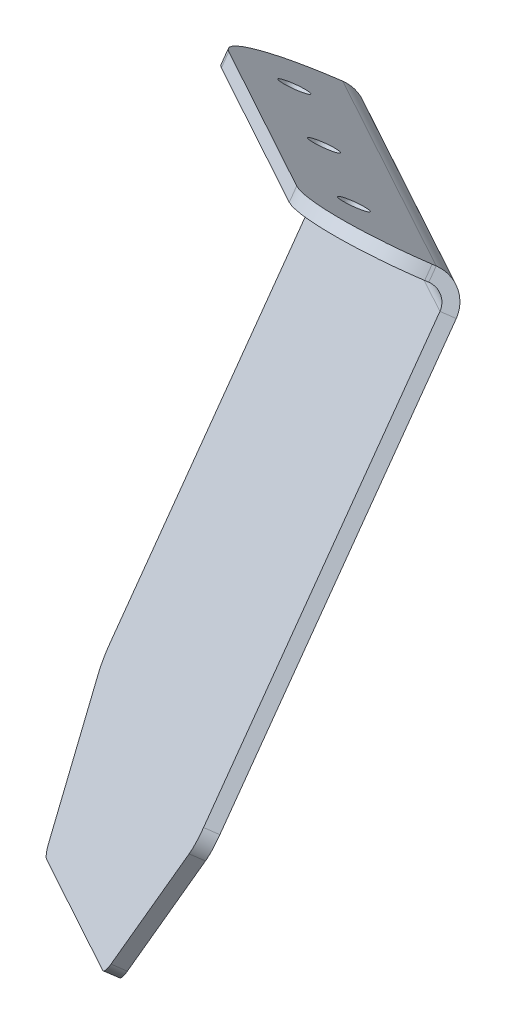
ISO-10303-21;
HEADER;
FILE_DESCRIPTION(('STEP AP214'),'2;1');
FILE_NAME('part.step','',(''),(''),'','','');
FILE_SCHEMA(('AUTOMOTIVE_DESIGN { 1 0 10303 214 1 1 1 1 }'));
ENDSEC;
DATA;
#1=APPLICATION_CONTEXT('core data for automotive mechanical design processes');
#2=APPLICATION_PROTOCOL_DEFINITION('international standard','automotive_design',2000,#1);
#3=PRODUCT_CONTEXT('',#1,'mechanical');
#4=PRODUCT('Part','Part','',(#3));
#5=PRODUCT_RELATED_PRODUCT_CATEGORY('part','',(#4));
#6=PRODUCT_DEFINITION_FORMATION('','',#4);
#7=PRODUCT_DEFINITION_CONTEXT('part definition',#1,'design');
#8=PRODUCT_DEFINITION('design','',#6,#7);
#9=PRODUCT_DEFINITION_SHAPE('','',#8);
#10=(LENGTH_UNIT() NAMED_UNIT(*) SI_UNIT(.MILLI.,.METRE.));
#11=(NAMED_UNIT(*) PLANE_ANGLE_UNIT() SI_UNIT($,.RADIAN.));
#12=(NAMED_UNIT(*) SI_UNIT($,.STERADIAN.) SOLID_ANGLE_UNIT());
#13=UNCERTAINTY_MEASURE_WITH_UNIT(LENGTH_MEASURE(1.E-05),#10,'distance_accuracy_value','');
#14=(GEOMETRIC_REPRESENTATION_CONTEXT(3) GLOBAL_UNCERTAINTY_ASSIGNED_CONTEXT((#13)) GLOBAL_UNIT_ASSIGNED_CONTEXT((#10,
#11,#12)) REPRESENTATION_CONTEXT('',''));
#15=CARTESIAN_POINT('',(0.,0.,0.));
#16=DIRECTION('',(0.,0.,1.));
#17=DIRECTION('',(1.,0.,0.));
#18=AXIS2_PLACEMENT_3D('',#15,#16,#17);
#19=CARTESIAN_POINT('',(-135.371691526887,-169.501902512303,88.8265453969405));
#20=DIRECTION('',(0.707106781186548,0.412762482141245,0.574131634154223));
#21=DIRECTION('',(0.5,0.282264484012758,-0.81873485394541));
#22=AXIS2_PLACEMENT_3D('',#19,#20,#21);
#23=CYLINDRICAL_SURFACE('',#22,3.175);
#24=CARTESIAN_POINT('',(-184.763100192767,-198.333361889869,48.7234507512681));
#25=DIRECTION('',(0.707106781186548,0.412762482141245,0.574131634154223));
#26=DIRECTION('',(0.630332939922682,0.,-0.776324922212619));
#27=AXIS2_PLACEMENT_3D('',#24,#25,#26);
#28=CIRCLE('',#27,3.175);
#29=CARTESIAN_POINT('',(-182.5180361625,-199.643882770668,46.9005828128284));
#30=VERTEX_POINT('',#29);
#31=CARTESIAN_POINT('',(-184.763100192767,-195.755437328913,46.8700943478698));
#32=VERTEX_POINT('',#31);
#33=EDGE_CURVE('E27',#30,#32,#28,.T.);
#34=ORIENTED_EDGE('',*,*,#33,.F.);
#35=DIRECTION('',(0.707106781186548,0.412762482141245,0.574131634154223));
#36=VECTOR('',#35,1.);
#37=CARTESIAN_POINT('',(-133.12662749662,-170.812423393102,87.0036774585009));
#38=LINE('',#37,#36);
#39=CARTESIAN_POINT('',(-83.7352188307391,-141.980964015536,127.106772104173));
#40=VERTEX_POINT('',#39);
#41=EDGE_CURVE('E467',#30,#40,#38,.T.);
#42=ORIENTED_EDGE('',*,*,#41,.T.);
#43=CARTESIAN_POINT('',(-85.9802828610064,-140.670443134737,128.929640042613));
#44=DIRECTION('',(0.707106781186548,0.412762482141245,0.574131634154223));
#45=DIRECTION('',(0.630332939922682,0.,-0.776324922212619));
#46=AXIS2_PLACEMENT_3D('',#43,#44,#45);
#47=CIRCLE('',#46,3.175);
#48=CARTESIAN_POINT('',(-85.9802828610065,-138.092518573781,127.076283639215));
#49=VERTEX_POINT('',#48);
#50=EDGE_CURVE('E228',#40,#49,#47,.T.);
#51=ORIENTED_EDGE('',*,*,#50,.T.);
#52=DIRECTION('',(0.707106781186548,0.412762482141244,0.574131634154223));
#53=VECTOR('',#52,1.);
#54=CARTESIAN_POINT('',(-66.2737357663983,-126.589131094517,143.076910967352));
#55=LINE('',#54,#53);
#56=EDGE_CURVE('E446',#32,#49,#55,.T.);
#57=ORIENTED_EDGE('',*,*,#56,.F.);
#58=EDGE_LOOP('',(#34,#42,#51,#57));
#59=FACE_BOUND('',#58,.T.);
#60=ADVANCED_FACE('F17',(#59),#23,.F.);
#61=CARTESIAN_POINT('',(-135.371691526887,-169.501902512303,88.8265453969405));
#62=DIRECTION('',(0.707106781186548,0.412762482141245,0.574131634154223));
#63=DIRECTION('',(0.5,0.282264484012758,-0.81873485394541));
#64=AXIS2_PLACEMENT_3D('',#61,#62,#63);
#65=CYLINDRICAL_SURFACE('',#64,5.715);
#66=CARTESIAN_POINT('',(-184.763100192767,-198.333361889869,48.7234507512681));
#67=DIRECTION('',(0.707106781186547,0.412762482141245,0.574131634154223));
#68=DIRECTION('',(0.630332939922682,0.,-0.776324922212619));
#69=AXIS2_PLACEMENT_3D('',#66,#67,#68);
#70=CIRCLE('',#69,5.715);
#71=CARTESIAN_POINT('',(-180.721984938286,-200.692299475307,45.4422884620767));
#72=VERTEX_POINT('',#71);
#73=CARTESIAN_POINT('',(-184.763100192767,-193.693097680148,45.3874092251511));
#74=VERTEX_POINT('',#73);
#75=EDGE_CURVE('E11',#72,#74,#70,.T.);
#76=ORIENTED_EDGE('',*,*,#75,.T.);
#77=DIRECTION('',(0.707106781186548,0.412762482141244,0.574131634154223));
#78=VECTOR('',#77,1.);
#79=CARTESIAN_POINT('',(-66.2737357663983,-124.526791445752,141.594225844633));
#80=LINE('',#79,#78);
#81=CARTESIAN_POINT('',(-85.9802828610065,-136.030178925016,125.593598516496));
#82=VERTEX_POINT('',#81);
#83=EDGE_CURVE('E556',#74,#82,#80,.T.);
#84=ORIENTED_EDGE('',*,*,#83,.T.);
#85=CARTESIAN_POINT('',(-85.9802828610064,-140.670443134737,128.929640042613));
#86=DIRECTION('',(0.707106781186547,0.412762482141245,0.574131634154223));
#87=DIRECTION('',(0.630332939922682,0.,-0.776324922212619));
#88=AXIS2_PLACEMENT_3D('',#85,#86,#87);
#89=CIRCLE('',#88,5.715);
#90=CARTESIAN_POINT('',(-81.9391676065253,-143.029380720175,125.648477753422));
#91=VERTEX_POINT('',#90);
#92=EDGE_CURVE('E20',#91,#82,#89,.T.);
#93=ORIENTED_EDGE('',*,*,#92,.F.);
#94=DIRECTION('',(0.707106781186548,0.412762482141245,0.574131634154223));
#95=VECTOR('',#94,1.);
#96=CARTESIAN_POINT('',(-131.330576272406,-171.86084009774,85.5453831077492));
#97=LINE('',#96,#95);
#98=EDGE_CURVE('E461',#72,#91,#97,.T.);
#99=ORIENTED_EDGE('',*,*,#98,.F.);
#100=EDGE_LOOP('',(#76,#84,#93,#99));
#101=FACE_BOUND('',#100,.T.);
#102=ADVANCED_FACE('F403',(#101),#65,.T.);
#103=CARTESIAN_POINT('',(-184.763100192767,-198.333361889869,48.7234507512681));
#104=DIRECTION('',(-0.707106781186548,-0.412762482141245,-0.574131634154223));
#105=DIRECTION('',(-0.630332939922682,0.,0.776324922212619));
#106=AXIS2_PLACEMENT_3D('',#103,#104,#105);
#107=PLANE('',#106);
#108=DIRECTION('',(0.707106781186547,-0.412762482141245,-0.574131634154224));
#109=VECTOR('',#108,1.);
#110=CARTESIAN_POINT('',(-182.5180361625,-199.643882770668,46.9005828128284));
#111=LINE('',#110,#109);
#112=EDGE_CURVE('E548',#30,#72,#111,.T.);
#113=ORIENTED_EDGE('',*,*,#112,.F.);
#114=ORIENTED_EDGE('',*,*,#33,.T.);
#115=DIRECTION('',(0.,0.811944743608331,-0.58373430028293));
#116=VECTOR('',#115,1.);
#117=CARTESIAN_POINT('',(-184.763100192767,-195.755437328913,46.8700943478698));
#118=LINE('',#117,#116);
#119=EDGE_CURVE('E484',#32,#74,#118,.T.);
#120=ORIENTED_EDGE('',*,*,#119,.T.);
#121=ORIENTED_EDGE('',*,*,#75,.F.);
#122=EDGE_LOOP('',(#113,#114,#120,#121));
#123=FACE_BOUND('',#122,.T.);
#124=ADVANCED_FACE('F395',(#123),#107,.T.);
#125=CARTESIAN_POINT('',(-85.9802828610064,-140.670443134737,128.929640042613));
#126=DIRECTION('',(-0.707106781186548,-0.412762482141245,-0.574131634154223));
#127=DIRECTION('',(-0.630332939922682,0.,0.776324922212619));
#128=AXIS2_PLACEMENT_3D('',#125,#126,#127);
#129=PLANE('',#128);
#130=DIRECTION('',(0.,0.811944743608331,-0.58373430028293));
#131=VECTOR('',#130,1.);
#132=CARTESIAN_POINT('',(-85.9802828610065,-138.092518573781,127.076283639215));
#133=LINE('',#132,#131);
#134=EDGE_CURVE('E450',#49,#82,#133,.T.);
#135=ORIENTED_EDGE('',*,*,#134,.F.);
#136=ORIENTED_EDGE('',*,*,#50,.F.);
#137=DIRECTION('',(0.707106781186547,-0.412762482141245,-0.574131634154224));
#138=VECTOR('',#137,1.);
#139=CARTESIAN_POINT('',(-83.7352188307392,-141.980964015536,127.106772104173));
#140=LINE('',#139,#138);
#141=EDGE_CURVE('E504',#40,#91,#140,.T.);
#142=ORIENTED_EDGE('',*,*,#141,.T.);
#143=ORIENTED_EDGE('',*,*,#92,.T.);
#144=EDGE_LOOP('',(#135,#136,#142,#143));
#145=FACE_BOUND('',#144,.T.);
#146=ADVANCED_FACE('F262',(#145),#129,.F.);
#147=CARTESIAN_POINT('',(-133.12662749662,-213.605971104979,117.769393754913));
#148=DIRECTION('',(0.707106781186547,-0.412762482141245,-0.574131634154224));
#149=DIRECTION('',(0.,-0.811944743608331,0.58373430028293));
#150=AXIS2_PLACEMENT_3D('',#147,#148,#149);
#151=PLANE('',#150);
#152=DIRECTION('',(0.5,0.865998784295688,-0.00679011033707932));
#153=VECTOR('',#152,1.);
#154=CARTESIAN_POINT('',(-83.7352188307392,-209.522587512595,175.664709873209));
#155=LINE('',#154,#153);
#156=CARTESIAN_POINT('',(-100.380603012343,-238.352352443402,175.890757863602));
#157=VERTEX_POINT('',#156);
#158=CARTESIAN_POINT('',(-85.0503468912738,-211.800386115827,175.682569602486));
#159=VERTEX_POINT('',#158);
#160=EDGE_CURVE('E179',#157,#159,#155,.T.);
#161=ORIENTED_EDGE('',*,*,#160,.T.);
#162=CARTESIAN_POINT('',(-88.2253468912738,-210.008006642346,170.483603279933));
#163=DIRECTION('',(-0.707106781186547,0.412762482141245,0.574131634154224));
#164=DIRECTION('',(-0.5,-0.865998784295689,0.0067901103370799));
#165=AXIS2_PLACEMENT_3D('',#162,#163,#164);
#166=CIRCLE('',#165,6.35);
#167=CARTESIAN_POINT('',(-83.7352188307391,-207.386964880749,174.129339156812));
#168=VERTEX_POINT('',#167);
#169=EDGE_CURVE('E209',#159,#168,#166,.T.);
#170=ORIENTED_EDGE('',*,*,#169,.T.);
#171=DIRECTION('',(0.,0.811944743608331,-0.58373430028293));
#172=VECTOR('',#171,1.);
#173=CARTESIAN_POINT('',(-83.7352188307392,-184.774511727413,157.872488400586));
#174=LINE('',#173,#172);
#175=EDGE_CURVE('E508',#168,#40,#174,.T.);
#176=ORIENTED_EDGE('',*,*,#175,.T.);
#177=ORIENTED_EDGE('',*,*,#41,.F.);
#178=DIRECTION('',(0.,-0.811944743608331,0.58373430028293));
#179=VECTOR('',#178,1.);
#180=CARTESIAN_POINT('',(-182.5180361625,-242.437430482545,77.6662991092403));
#181=LINE('',#180,#179);
#182=CARTESIAN_POINT('',(-182.5180361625,-265.049883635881,93.9231498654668));
#183=VERTEX_POINT('',#182);
#184=EDGE_CURVE('E551',#30,#183,#181,.T.);
#185=ORIENTED_EDGE('',*,*,#184,.T.);
#186=CARTESIAN_POINT('',(-178.027908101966,-262.428841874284,97.5688857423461));
#187=DIRECTION('',(-0.707106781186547,0.412762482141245,0.574131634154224));
#188=DIRECTION('',(-0.5,-0.865998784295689,0.0067901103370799));
#189=AXIS2_PLACEMENT_3D('',#186,#187,#188);
#190=CIRCLE('',#189,6.35);
#191=CARTESIAN_POINT('',(-181.202908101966,-267.927934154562,97.6120029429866));
#192=VERTEX_POINT('',#191);
#193=EDGE_CURVE('E578',#183,#192,#190,.T.);
#194=ORIENTED_EDGE('',*,*,#193,.T.);
#195=DIRECTION('',(0.5,-0.282264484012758,0.81873485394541));
#196=VECTOR('',#195,1.);
#197=CARTESIAN_POINT('',(-164.557523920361,-277.324735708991,124.868315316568));
#198=LINE('',#197,#196);
#199=CARTESIAN_POINT('',(-165.872651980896,-276.582307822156,122.714832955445));
#200=VERTEX_POINT('',#199);
#201=EDGE_CURVE('E531',#192,#200,#198,.T.);
#202=ORIENTED_EDGE('',*,*,#201,.T.);
#203=CARTESIAN_POINT('',(-162.697651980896,-271.083215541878,122.671715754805));
#204=DIRECTION('',(-0.707106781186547,0.412762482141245,0.574131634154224));
#205=DIRECTION('',(-0.5,-0.865998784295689,0.0067901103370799));
#206=AXIS2_PLACEMENT_3D('',#203,#204,#205);
#207=CIRCLE('',#206,6.35);
#208=CARTESIAN_POINT('',(-162.697651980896,-276.239064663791,126.378428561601));
#209=VERTEX_POINT('',#208);
#210=EDGE_CURVE('E479',#200,#209,#207,.T.);
#211=ORIENTED_EDGE('',*,*,#210,.T.);
#212=DIRECTION('',(0.707106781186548,0.412762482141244,0.574131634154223));
#213=VECTOR('',#212,1.);
#214=CARTESIAN_POINT('',(-133.12662749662,-258.977443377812,150.388466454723));
#215=LINE('',#214,#213);
#216=CARTESIAN_POINT('',(-103.555603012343,-241.715822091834,174.398504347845));
#217=VERTEX_POINT('',#216);
#218=EDGE_CURVE('E497',#209,#217,#215,.T.);
#219=ORIENTED_EDGE('',*,*,#218,.T.);
#220=CARTESIAN_POINT('',(-103.555603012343,-236.559972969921,170.691791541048));
#221=DIRECTION('',(-0.707106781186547,0.412762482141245,0.574131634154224));
#222=DIRECTION('',(-0.5,-0.865998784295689,0.0067901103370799));
#223=AXIS2_PLACEMENT_3D('',#220,#221,#222);
#224=CIRCLE('',#223,6.35);
#225=EDGE_CURVE('E195',#217,#157,#224,.T.);
#226=ORIENTED_EDGE('',*,*,#225,.T.);
#227=EDGE_LOOP('',(#161,#170,#176,#177,#185,#194,#202,#211,#219,#226));
#228=FACE_BOUND('',#227,.T.);
#229=ADVANCED_FACE('F258',(#228),#151,.F.);
#230=CARTESIAN_POINT('',(-131.330576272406,-214.654387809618,116.311099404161));
#231=DIRECTION('',(0.707106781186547,-0.412762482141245,-0.574131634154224));
#232=DIRECTION('',(0.,-0.811944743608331,0.58373430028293));
#233=AXIS2_PLACEMENT_3D('',#230,#231,#232);
#234=PLANE('',#233);
#235=DIRECTION('',(0.5,0.865998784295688,-0.00679011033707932));
#236=VECTOR('',#235,1.);
#237=CARTESIAN_POINT('',(-81.9391676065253,-210.571004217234,174.206415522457));
#238=LINE('',#237,#236);
#239=CARTESIAN_POINT('',(-98.584551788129,-239.400769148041,174.432463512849));
#240=VERTEX_POINT('',#239);
#241=CARTESIAN_POINT('',(-83.2542956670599,-212.848802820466,174.224275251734));
#242=VERTEX_POINT('',#241);
#243=EDGE_CURVE('E186',#240,#242,#238,.T.);
#244=ORIENTED_EDGE('',*,*,#243,.F.);
#245=CARTESIAN_POINT('',(-101.759551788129,-237.60838967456,169.233497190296));
#246=DIRECTION('',(-0.707106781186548,0.412762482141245,0.574131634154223));
#247=DIRECTION('',(-0.630332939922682,0.,-0.776324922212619));
#248=AXIS2_PLACEMENT_3D('',#245,#246,#247);
#249=CIRCLE('',#248,6.35);
#250=CARTESIAN_POINT('',(-101.759551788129,-242.764238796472,172.940209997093));
#251=VERTEX_POINT('',#250);
#252=EDGE_CURVE('E41',#251,#240,#249,.T.);
#253=ORIENTED_EDGE('',*,*,#252,.F.);
#254=DIRECTION('',(0.707106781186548,0.412762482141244,0.574131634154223));
#255=VECTOR('',#254,1.);
#256=CARTESIAN_POINT('',(-131.330576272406,-260.025860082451,148.930172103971));
#257=LINE('',#256,#255);
#258=CARTESIAN_POINT('',(-160.901600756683,-277.28748136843,124.920134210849));
#259=VERTEX_POINT('',#258);
#260=EDGE_CURVE('E496',#259,#251,#257,.T.);
#261=ORIENTED_EDGE('',*,*,#260,.F.);
#262=CARTESIAN_POINT('',(-160.901600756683,-272.131632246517,121.213421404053));
#263=DIRECTION('',(-0.707106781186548,0.412762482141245,0.574131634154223));
#264=DIRECTION('',(-0.630332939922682,0.,-0.776324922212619));
#265=AXIS2_PLACEMENT_3D('',#262,#263,#264);
#266=CIRCLE('',#265,6.35);
#267=CARTESIAN_POINT('',(-164.076600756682,-277.630724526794,121.256538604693));
#268=VERTEX_POINT('',#267);
#269=EDGE_CURVE('E478',#268,#259,#266,.T.);
#270=ORIENTED_EDGE('',*,*,#269,.F.);
#271=DIRECTION('',(0.5,-0.282264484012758,0.81873485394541));
#272=VECTOR('',#271,1.);
#273=CARTESIAN_POINT('',(-162.761472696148,-278.37315241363,123.410020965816));
#274=LINE('',#273,#272);
#275=CARTESIAN_POINT('',(-179.406856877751,-268.9763508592,96.1537085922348));
#276=VERTEX_POINT('',#275);
#277=EDGE_CURVE('E530',#276,#268,#274,.T.);
#278=ORIENTED_EDGE('',*,*,#277,.F.);
#279=CARTESIAN_POINT('',(-176.231856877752,-263.477258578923,96.1105913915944));
#280=DIRECTION('',(-0.707106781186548,0.412762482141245,0.574131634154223));
#281=DIRECTION('',(-0.630332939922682,0.,-0.776324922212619));
#282=AXIS2_PLACEMENT_3D('',#279,#280,#281);
#283=CIRCLE('',#282,6.35);
#284=CARTESIAN_POINT('',(-180.721984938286,-266.09830034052,92.4648555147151));
#285=VERTEX_POINT('',#284);
#286=EDGE_CURVE('E587',#285,#276,#283,.T.);
#287=ORIENTED_EDGE('',*,*,#286,.F.);
#288=DIRECTION('',(0.,-0.811944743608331,0.58373430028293));
#289=VECTOR('',#288,1.);
#290=CARTESIAN_POINT('',(-180.721984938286,-243.485847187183,76.2080047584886));
#291=LINE('',#290,#289);
#292=EDGE_CURVE('E509',#72,#285,#291,.T.);
#293=ORIENTED_EDGE('',*,*,#292,.F.);
#294=ORIENTED_EDGE('',*,*,#98,.T.);
#295=DIRECTION('',(0.,0.811944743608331,-0.58373430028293));
#296=VECTOR('',#295,1.);
#297=CARTESIAN_POINT('',(-81.9391676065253,-185.822928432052,156.414194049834));
#298=LINE('',#297,#296);
#299=CARTESIAN_POINT('',(-81.9391676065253,-208.435381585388,172.67104480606));
#300=VERTEX_POINT('',#299);
#301=EDGE_CURVE('E202',#300,#91,#298,.T.);
#302=ORIENTED_EDGE('',*,*,#301,.F.);
#303=CARTESIAN_POINT('',(-86.4292956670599,-211.056423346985,169.025308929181));
#304=DIRECTION('',(-0.707106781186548,0.412762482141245,0.574131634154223));
#305=DIRECTION('',(-0.630332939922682,0.,-0.776324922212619));
#306=AXIS2_PLACEMENT_3D('',#303,#304,#305);
#307=CIRCLE('',#306,6.35);
#308=EDGE_CURVE('E198',#242,#300,#307,.T.);
#309=ORIENTED_EDGE('',*,*,#308,.F.);
#310=EDGE_LOOP('',(#244,#253,#261,#270,#278,#287,#293,#294,#302,#309));
#311=FACE_BOUND('',#310,.T.);
#312=ADVANCED_FACE('F199',(#311),#234,.T.);
#313=CARTESIAN_POINT('',(-103.555603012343,-236.559972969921,170.691791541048));
#314=DIRECTION('',(0.707106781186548,-0.412762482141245,-0.574131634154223));
#315=DIRECTION('',(-0.630332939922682,0.,-0.776324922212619));
#316=AXIS2_PLACEMENT_3D('',#313,#314,#315);
#317=CYLINDRICAL_SURFACE('',#316,6.35);
#318=ORIENTED_EDGE('',*,*,#225,.F.);
#319=DIRECTION('',(0.707106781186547,-0.412762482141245,-0.574131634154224));
#320=VECTOR('',#319,1.);
#321=CARTESIAN_POINT('',(-103.555603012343,-241.715822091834,174.398504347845));
#322=LINE('',#321,#320);
#323=EDGE_CURVE('E563',#217,#251,#322,.T.);
#324=ORIENTED_EDGE('',*,*,#323,.T.);
#325=ORIENTED_EDGE('',*,*,#252,.T.);
#326=DIRECTION('',(0.707106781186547,-0.412762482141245,-0.574131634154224));
#327=VECTOR('',#326,1.);
#328=CARTESIAN_POINT('',(-100.380603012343,-238.352352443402,175.890757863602));
#329=LINE('',#328,#327);
#330=EDGE_CURVE('E192',#157,#240,#329,.T.);
#331=ORIENTED_EDGE('',*,*,#330,.F.);
#332=EDGE_LOOP('',(#318,#324,#325,#331));
#333=FACE_BOUND('',#332,.T.);
#334=ADVANCED_FACE('F376',(#333),#317,.T.);
#335=CARTESIAN_POINT('',(-83.7352188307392,-209.522587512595,175.664709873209));
#336=DIRECTION('',(0.5,-0.282264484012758,0.81873485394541));
#337=DIRECTION('',(-0.491602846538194,-0.870819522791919,0.));
#338=AXIS2_PLACEMENT_3D('',#335,#336,#337);
#339=PLANE('',#338);
#340=DIRECTION('',(0.707106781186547,-0.412762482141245,-0.574131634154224));
#341=VECTOR('',#340,1.);
#342=CARTESIAN_POINT('',(-85.0503468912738,-211.800386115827,175.682569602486));
#343=LINE('',#342,#341);
#344=EDGE_CURVE('E190',#159,#242,#343,.T.);
#345=ORIENTED_EDGE('',*,*,#344,.F.);
#346=ORIENTED_EDGE('',*,*,#160,.F.);
#347=ORIENTED_EDGE('',*,*,#330,.T.);
#348=ORIENTED_EDGE('',*,*,#243,.T.);
#349=EDGE_LOOP('',(#345,#346,#347,#348));
#350=FACE_BOUND('',#349,.T.);
#351=ADVANCED_FACE('F188',(#350),#339,.T.);
#352=CARTESIAN_POINT('',(-88.2253468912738,-210.008006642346,170.483603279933));
#353=DIRECTION('',(0.707106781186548,-0.412762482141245,-0.574131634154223));
#354=DIRECTION('',(-0.630332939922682,0.,-0.776324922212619));
#355=AXIS2_PLACEMENT_3D('',#352,#353,#354);
#356=CYLINDRICAL_SURFACE('',#355,6.35);
#357=DIRECTION('',(0.707106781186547,-0.412762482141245,-0.574131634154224));
#358=VECTOR('',#357,1.);
#359=CARTESIAN_POINT('',(-83.7352188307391,-207.386964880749,174.129339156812));
#360=LINE('',#359,#358);
#361=EDGE_CURVE('E597',#168,#300,#360,.T.);
#362=ORIENTED_EDGE('',*,*,#361,.F.);
#363=ORIENTED_EDGE('',*,*,#169,.F.);
#364=ORIENTED_EDGE('',*,*,#344,.T.);
#365=ORIENTED_EDGE('',*,*,#308,.T.);
#366=EDGE_LOOP('',(#362,#363,#364,#365));
#367=FACE_BOUND('',#366,.T.);
#368=ADVANCED_FACE('F208',(#367),#356,.T.);
#369=CARTESIAN_POINT('',(-83.7352188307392,-184.774511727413,157.872488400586));
#370=DIRECTION('',(-0.707106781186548,-0.412762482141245,-0.574131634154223));
#371=DIRECTION('',(-0.630332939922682,0.,0.776324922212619));
#372=AXIS2_PLACEMENT_3D('',#369,#370,#371);
#373=PLANE('',#372);
#374=ORIENTED_EDGE('',*,*,#141,.F.);
#375=ORIENTED_EDGE('',*,*,#175,.F.);
#376=ORIENTED_EDGE('',*,*,#361,.T.);
#377=ORIENTED_EDGE('',*,*,#301,.T.);
#378=EDGE_LOOP('',(#374,#375,#376,#377));
#379=FACE_BOUND('',#378,.T.);
#380=ADVANCED_FACE('F245',(#379),#373,.F.);
#381=CARTESIAN_POINT('',(-182.5180361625,-242.437430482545,77.6662991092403));
#382=DIRECTION('',(0.707106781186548,0.412762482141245,0.574131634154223));
#383=DIRECTION('',(0.,-0.81194474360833,0.583734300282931));
#384=AXIS2_PLACEMENT_3D('',#381,#382,#383);
#385=PLANE('',#384);
#386=DIRECTION('',(0.707106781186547,-0.412762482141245,-0.574131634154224));
#387=VECTOR('',#386,1.);
#388=CARTESIAN_POINT('',(-182.5180361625,-265.049883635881,93.9231498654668));
#389=LINE('',#388,#387);
#390=EDGE_CURVE('E582',#183,#285,#389,.T.);
#391=ORIENTED_EDGE('',*,*,#390,.F.);
#392=ORIENTED_EDGE('',*,*,#184,.F.);
#393=ORIENTED_EDGE('',*,*,#112,.T.);
#394=ORIENTED_EDGE('',*,*,#292,.T.);
#395=EDGE_LOOP('',(#391,#392,#393,#394));
#396=FACE_BOUND('',#395,.T.);
#397=ADVANCED_FACE('F240',(#396),#385,.F.);
#398=CARTESIAN_POINT('',(-178.027908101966,-262.428841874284,97.5688857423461));
#399=DIRECTION('',(0.707106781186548,-0.412762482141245,-0.574131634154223));
#400=DIRECTION('',(-0.630332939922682,0.,-0.776324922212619));
#401=AXIS2_PLACEMENT_3D('',#398,#399,#400);
#402=CYLINDRICAL_SURFACE('',#401,6.35);
#403=DIRECTION('',(0.707106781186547,-0.412762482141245,-0.574131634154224));
#404=VECTOR('',#403,1.);
#405=CARTESIAN_POINT('',(-181.202908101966,-267.927934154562,97.6120029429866));
#406=LINE('',#405,#404);
#407=EDGE_CURVE('E526',#192,#276,#406,.T.);
#408=ORIENTED_EDGE('',*,*,#407,.F.);
#409=ORIENTED_EDGE('',*,*,#193,.F.);
#410=ORIENTED_EDGE('',*,*,#390,.T.);
#411=ORIENTED_EDGE('',*,*,#286,.T.);
#412=EDGE_LOOP('',(#408,#409,#410,#411));
#413=FACE_BOUND('',#412,.T.);
#414=ADVANCED_FACE('F244',(#413),#402,.T.);
#415=CARTESIAN_POINT('',(-164.557523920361,-277.324735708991,124.868315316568));
#416=DIRECTION('',(-0.5,-0.865998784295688,0.0067901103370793));
#417=DIRECTION('',(-0.866018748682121,0.500011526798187,0.));
#418=AXIS2_PLACEMENT_3D('',#415,#416,#417);
#419=PLANE('',#418);
#420=DIRECTION('',(0.707106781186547,-0.412762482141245,-0.574131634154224));
#421=VECTOR('',#420,1.);
#422=CARTESIAN_POINT('',(-165.872651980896,-276.582307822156,122.714832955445));
#423=LINE('',#422,#421);
#424=EDGE_CURVE('E474',#200,#268,#423,.T.);
#425=ORIENTED_EDGE('',*,*,#424,.F.);
#426=ORIENTED_EDGE('',*,*,#201,.F.);
#427=ORIENTED_EDGE('',*,*,#407,.T.);
#428=ORIENTED_EDGE('',*,*,#277,.T.);
#429=EDGE_LOOP('',(#425,#426,#427,#428));
#430=FACE_BOUND('',#429,.T.);
#431=ADVANCED_FACE('F341',(#430),#419,.T.);
#432=CARTESIAN_POINT('',(-162.697651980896,-271.083215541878,122.671715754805));
#433=DIRECTION('',(0.707106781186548,-0.412762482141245,-0.574131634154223));
#434=DIRECTION('',(-0.630332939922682,0.,-0.776324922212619));
#435=AXIS2_PLACEMENT_3D('',#432,#433,#434);
#436=CYLINDRICAL_SURFACE('',#435,6.35);
#437=DIRECTION('',(0.707106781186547,-0.412762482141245,-0.574131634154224));
#438=VECTOR('',#437,1.);
#439=CARTESIAN_POINT('',(-162.697651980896,-276.239064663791,126.378428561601));
#440=LINE('',#439,#438);
#441=EDGE_CURVE('E492',#209,#259,#440,.T.);
#442=ORIENTED_EDGE('',*,*,#441,.F.);
#443=ORIENTED_EDGE('',*,*,#210,.F.);
#444=ORIENTED_EDGE('',*,*,#424,.T.);
#445=ORIENTED_EDGE('',*,*,#269,.T.);
#446=EDGE_LOOP('',(#442,#443,#444,#445));
#447=FACE_BOUND('',#446,.T.);
#448=ADVANCED_FACE('F337',(#447),#436,.T.);
#449=CARTESIAN_POINT('',(-133.12662749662,-258.977443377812,150.388466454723));
#450=DIRECTION('',(0.,0.811944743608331,-0.58373430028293));
#451=DIRECTION('',(-1.,0.,0.));
#452=AXIS2_PLACEMENT_3D('',#449,#450,#451);
#453=PLANE('',#452);
#454=ORIENTED_EDGE('',*,*,#323,.F.);
#455=ORIENTED_EDGE('',*,*,#218,.F.);
#456=ORIENTED_EDGE('',*,*,#441,.T.);
#457=ORIENTED_EDGE('',*,*,#260,.T.);
#458=EDGE_LOOP('',(#454,#455,#456,#457));
#459=FACE_BOUND('',#458,.T.);
#460=ADVANCED_FACE('F332',(#459),#453,.F.);
#461=CARTESIAN_POINT('',(0.,-165.275383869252,89.2662995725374));
#462=DIRECTION('',(0.,-0.811944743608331,0.58373430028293));
#463=DIRECTION('',(-1.,0.,0.));
#464=AXIS2_PLACEMENT_3D('',#461,#462,#463);
#465=PLANE('',#464);
#466=DIRECTION('',(-0.707106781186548,-0.412762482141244,-0.574131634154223));
#467=VECTOR('',#466,1.);
#468=CARTESIAN_POINT('',(-149.291088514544,-158.798748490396,98.2749702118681));
#469=LINE('',#468,#467);
#470=CARTESIAN_POINT('',(-113.370064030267,-137.830414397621,127.440857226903));
#471=VERTEX_POINT('',#470);
#472=CARTESIAN_POINT('',(-185.212112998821,-179.767082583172,69.1090831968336));
#473=VERTEX_POINT('',#472);
#474=EDGE_CURVE('E516',#471,#473,#469,.T.);
#475=ORIENTED_EDGE('',*,*,#474,.T.);
#476=CARTESIAN_POINT('',(-171.741728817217,-187.630207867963,58.1718755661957));
#477=DIRECTION('',(0.,-0.811944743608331,0.58373430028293));
#478=DIRECTION('',(0.,-0.58373430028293,-0.811944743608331));
#479=AXIS2_PLACEMENT_3D('',#476,#477,#478);
#480=CIRCLE('',#479,19.05);
#481=CARTESIAN_POINT('',(-185.212112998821,-195.493333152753,47.2346679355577));
#482=VERTEX_POINT('',#481);
#483=EDGE_CURVE('E503',#473,#482,#480,.T.);
#484=ORIENTED_EDGE('',*,*,#483,.T.);
#485=DIRECTION('',(0.707106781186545,-0.412762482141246,-0.574131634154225));
#486=VECTOR('',#485,1.);
#487=CARTESIAN_POINT('',(-182.967048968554,-196.803854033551,45.411799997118));
#488=LINE('',#487,#486);
#489=EDGE_CURVE('E488',#482,#32,#488,.T.);
#490=ORIENTED_EDGE('',*,*,#489,.T.);
#491=ORIENTED_EDGE('',*,*,#56,.T.);
#492=DIRECTION('',(-0.707106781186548,0.412762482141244,0.574131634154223));
#493=VECTOR('',#492,1.);
#494=CARTESIAN_POINT('',(-84.1842316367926,-139.14093527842,125.617989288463));
#495=LINE('',#494,#493);
#496=CARTESIAN_POINT('',(-86.4292956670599,-137.830414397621,127.440857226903));
#497=VERTEX_POINT('',#496);
#498=EDGE_CURVE('E442',#49,#497,#495,.T.);
#499=ORIENTED_EDGE('',*,*,#498,.T.);
#500=CARTESIAN_POINT('',(-99.8996798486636,-145.693539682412,116.503649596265));
#501=DIRECTION('',(0.,-0.811944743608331,0.58373430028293));
#502=DIRECTION('',(0.,-0.58373430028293,-0.811944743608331));
#503=AXIS2_PLACEMENT_3D('',#500,#501,#502);
#504=CIRCLE('',#503,19.05);
#505=EDGE_CURVE('E429',#497,#471,#504,.T.);
#506=ORIENTED_EDGE('',*,*,#505,.T.);
#507=EDGE_LOOP('',(#475,#484,#490,#491,#499,#506));
#508=FACE_BOUND('',#507,.T.);
#509=CARTESIAN_POINT('',(-173.986792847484,-181.077603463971,67.286215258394));
#510=DIRECTION('',(0.,0.811944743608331,-0.58373430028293));
#511=DIRECTION('',(0.,0.58373430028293,0.811944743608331));
#512=AXIS2_PLACEMENT_3D('',#509,#510,#511);
#513=CIRCLE('',#512,2.5527);
#514=CARTESIAN_POINT('',(-173.986792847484,-179.587504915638,69.358866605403));
#515=VERTEX_POINT('',#514);
#516=EDGE_CURVE('E438',#515,#515,#513,.T.);
#517=ORIENTED_EDGE('',*,*,#516,.T.);
#518=EDGE_LOOP('',(#517));
#519=FACE_BOUND('',#518,.T.);
#520=CARTESIAN_POINT('',(-111.125,-144.383018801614,118.326517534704));
#521=DIRECTION('',(0.,0.811944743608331,-0.58373430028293));
#522=DIRECTION('',(0.,0.58373430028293,0.811944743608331));
#523=AXIS2_PLACEMENT_3D('',#520,#521,#522);
#524=CIRCLE('',#523,2.5527);
#525=CARTESIAN_POINT('',(-111.125,-142.892920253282,120.399168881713));
#526=VERTEX_POINT('',#525);
#527=EDGE_CURVE('E538',#526,#526,#524,.T.);
#528=ORIENTED_EDGE('',*,*,#527,.T.);
#529=EDGE_LOOP('',(#528));
#530=FACE_BOUND('',#529,.T.);
#531=CARTESIAN_POINT('',(-142.555896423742,-162.730311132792,92.8063663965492));
#532=DIRECTION('',(0.,0.811944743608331,-0.58373430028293));
#533=DIRECTION('',(0.,0.58373430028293,0.811944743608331));
#534=AXIS2_PLACEMENT_3D('',#531,#532,#533);
#535=CIRCLE('',#534,2.5527);
#536=CARTESIAN_POINT('',(-142.555896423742,-161.24021258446,94.8790177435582));
#537=VERTEX_POINT('',#536);
#538=EDGE_CURVE('E462',#537,#537,#535,.T.);
#539=ORIENTED_EDGE('',*,*,#538,.T.);
#540=EDGE_LOOP('',(#539));
#541=FACE_BOUND('',#540,.T.);
#542=ADVANCED_FACE('F324',(#508,#519,#530,#541),#465,.T.);
#543=CARTESIAN_POINT('',(0.,-163.213044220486,87.7836144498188));
#544=DIRECTION('',(0.,-0.811944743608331,0.58373430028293));
#545=DIRECTION('',(-1.,0.,0.));
#546=AXIS2_PLACEMENT_3D('',#543,#544,#545);
#547=PLANE('',#546);
#548=DIRECTION('',(-0.707106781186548,-0.412762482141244,-0.574131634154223));
#549=VECTOR('',#548,1.);
#550=CARTESIAN_POINT('',(-149.291088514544,-156.736408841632,96.7922850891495));
#551=LINE('',#550,#549);
#552=CARTESIAN_POINT('',(-113.370064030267,-135.768074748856,125.958172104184));
#553=VERTEX_POINT('',#552);
#554=CARTESIAN_POINT('',(-185.212112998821,-177.704742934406,67.626398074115));
#555=VERTEX_POINT('',#554);
#556=EDGE_CURVE('E471',#553,#555,#551,.T.);
#557=ORIENTED_EDGE('',*,*,#556,.F.);
#558=CARTESIAN_POINT('',(-99.8996798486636,-143.631200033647,115.020964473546));
#559=DIRECTION('',(0.,-0.811944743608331,0.58373430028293));
#560=DIRECTION('',(0.,-0.58373430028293,-0.811944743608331));
#561=AXIS2_PLACEMENT_3D('',#558,#559,#560);
#562=CIRCLE('',#561,19.05);
#563=CARTESIAN_POINT('',(-86.4292956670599,-135.768074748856,125.958172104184));
#564=VERTEX_POINT('',#563);
#565=EDGE_CURVE('E437',#564,#553,#562,.T.);
#566=ORIENTED_EDGE('',*,*,#565,.F.);
#567=DIRECTION('',(-0.707106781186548,0.412762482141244,0.574131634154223));
#568=VECTOR('',#567,1.);
#569=CARTESIAN_POINT('',(-84.1842316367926,-137.078595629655,124.135304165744));
#570=LINE('',#569,#568);
#571=EDGE_CURVE('E454',#82,#564,#570,.T.);
#572=ORIENTED_EDGE('',*,*,#571,.F.);
#573=ORIENTED_EDGE('',*,*,#83,.F.);
#574=DIRECTION('',(0.707106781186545,-0.412762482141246,-0.574131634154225));
#575=VECTOR('',#574,1.);
#576=CARTESIAN_POINT('',(-182.967048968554,-194.741514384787,43.9291148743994));
#577=LINE('',#576,#575);
#578=CARTESIAN_POINT('',(-185.212112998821,-193.430993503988,45.7519828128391));
#579=VERTEX_POINT('',#578);
#580=EDGE_CURVE('E513',#579,#74,#577,.T.);
#581=ORIENTED_EDGE('',*,*,#580,.F.);
#582=CARTESIAN_POINT('',(-171.741728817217,-185.567868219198,56.689190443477));
#583=DIRECTION('',(0.,-0.811944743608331,0.58373430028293));
#584=DIRECTION('',(0.,-0.58373430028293,-0.811944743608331));
#585=AXIS2_PLACEMENT_3D('',#582,#583,#584);
#586=CIRCLE('',#585,19.05);
#587=EDGE_CURVE('E502',#555,#579,#586,.T.);
#588=ORIENTED_EDGE('',*,*,#587,.F.);
#589=EDGE_LOOP('',(#557,#566,#572,#573,#581,#588));
#590=FACE_BOUND('',#589,.T.);
#591=CARTESIAN_POINT('',(-173.986792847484,-179.015263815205,65.8035301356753));
#592=DIRECTION('',(0.,0.811944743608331,-0.58373430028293));
#593=DIRECTION('',(0.,0.58373430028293,0.811944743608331));
#594=AXIS2_PLACEMENT_3D('',#591,#592,#593);
#595=CIRCLE('',#594,2.5527);
#596=CARTESIAN_POINT('',(-173.986792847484,-177.525165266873,67.8761814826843));
#597=VERTEX_POINT('',#596);
#598=EDGE_CURVE('E543',#597,#597,#595,.T.);
#599=ORIENTED_EDGE('',*,*,#598,.F.);
#600=EDGE_LOOP('',(#599));
#601=FACE_BOUND('',#600,.T.);
#602=CARTESIAN_POINT('',(-111.125,-142.320679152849,116.843832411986));
#603=DIRECTION('',(0.,0.811944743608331,-0.58373430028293));
#604=DIRECTION('',(0.,0.58373430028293,0.811944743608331));
#605=AXIS2_PLACEMENT_3D('',#602,#603,#604);
#606=CIRCLE('',#605,2.5527);
#607=CARTESIAN_POINT('',(-111.125,-140.830580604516,118.916483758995));
#608=VERTEX_POINT('',#607);
#609=EDGE_CURVE('E465',#608,#608,#606,.T.);
#610=ORIENTED_EDGE('',*,*,#609,.F.);
#611=EDGE_LOOP('',(#610));
#612=FACE_BOUND('',#611,.T.);
#613=CARTESIAN_POINT('',(-142.555896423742,-160.667971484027,91.3236812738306));
#614=DIRECTION('',(0.,0.811944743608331,-0.58373430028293));
#615=DIRECTION('',(0.,0.58373430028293,0.811944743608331));
#616=AXIS2_PLACEMENT_3D('',#613,#614,#615);
#617=CIRCLE('',#616,2.5527);
#618=CARTESIAN_POINT('',(-142.555896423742,-159.177872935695,93.3963326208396));
#619=VERTEX_POINT('',#618);
#620=EDGE_CURVE('E466',#619,#619,#617,.T.);
#621=ORIENTED_EDGE('',*,*,#620,.F.);
#622=EDGE_LOOP('',(#621));
#623=FACE_BOUND('',#622,.T.);
#624=ADVANCED_FACE('F316',(#590,#601,#612,#623),#547,.F.);
#625=CARTESIAN_POINT('',(-99.8996798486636,-145.693539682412,116.503649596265));
#626=DIRECTION('',(0.,-0.811944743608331,0.58373430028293));
#627=DIRECTION('',(0.,-0.58373430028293,-0.811944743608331));
#628=AXIS2_PLACEMENT_3D('',#625,#626,#627);
#629=CYLINDRICAL_SURFACE('',#628,19.05);
#630=ORIENTED_EDGE('',*,*,#505,.F.);
#631=DIRECTION('',(0.,0.811944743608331,-0.58373430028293));
#632=VECTOR('',#631,1.);
#633=CARTESIAN_POINT('',(-86.4292956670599,-137.830414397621,127.440857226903));
#634=LINE('',#633,#632);
#635=EDGE_CURVE('E432',#497,#564,#634,.T.);
#636=ORIENTED_EDGE('',*,*,#635,.T.);
#637=ORIENTED_EDGE('',*,*,#565,.T.);
#638=DIRECTION('',(0.,0.811944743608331,-0.58373430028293));
#639=VECTOR('',#638,1.);
#640=CARTESIAN_POINT('',(-113.370064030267,-137.830414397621,127.440857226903));
#641=LINE('',#640,#639);
#642=EDGE_CURVE('E434',#471,#553,#641,.T.);
#643=ORIENTED_EDGE('',*,*,#642,.F.);
#644=EDGE_LOOP('',(#630,#636,#637,#643));
#645=FACE_BOUND('',#644,.T.);
#646=ADVANCED_FACE('F301',(#645),#629,.T.);
#647=CARTESIAN_POINT('',(-173.986792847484,-181.077603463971,67.286215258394));
#648=DIRECTION('',(0.,-0.811944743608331,0.58373430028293));
#649=DIRECTION('',(0.,-0.58373430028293,-0.811944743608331));
#650=AXIS2_PLACEMENT_3D('',#647,#648,#649);
#651=CYLINDRICAL_SURFACE('',#650,2.5527);
#652=ORIENTED_EDGE('',*,*,#516,.F.);
#653=EDGE_LOOP('',(#652));
#654=FACE_BOUND('',#653,.T.);
#655=ORIENTED_EDGE('',*,*,#598,.T.);
#656=EDGE_LOOP('',(#655));
#657=FACE_BOUND('',#656,.T.);
#658=ADVANCED_FACE('F297',(#654,#657),#651,.F.);
#659=CARTESIAN_POINT('',(-111.125,-144.383018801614,118.326517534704));
#660=DIRECTION('',(0.,-0.811944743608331,0.58373430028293));
#661=DIRECTION('',(0.,-0.58373430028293,-0.811944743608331));
#662=AXIS2_PLACEMENT_3D('',#659,#660,#661);
#663=CYLINDRICAL_SURFACE('',#662,2.5527);
#664=ORIENTED_EDGE('',*,*,#527,.F.);
#665=EDGE_LOOP('',(#664));
#666=FACE_BOUND('',#665,.T.);
#667=ORIENTED_EDGE('',*,*,#609,.T.);
#668=EDGE_LOOP('',(#667));
#669=FACE_BOUND('',#668,.T.);
#670=ADVANCED_FACE('F292',(#666,#669),#663,.F.);
#671=CARTESIAN_POINT('',(-142.555896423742,-162.730311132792,92.8063663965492));
#672=DIRECTION('',(0.,-0.811944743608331,0.58373430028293));
#673=DIRECTION('',(0.,-0.58373430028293,-0.811944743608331));
#674=AXIS2_PLACEMENT_3D('',#671,#672,#673);
#675=CYLINDRICAL_SURFACE('',#674,2.5527);
#676=ORIENTED_EDGE('',*,*,#538,.F.);
#677=EDGE_LOOP('',(#676));
#678=FACE_BOUND('',#677,.T.);
#679=ORIENTED_EDGE('',*,*,#620,.T.);
#680=EDGE_LOOP('',(#679));
#681=FACE_BOUND('',#680,.T.);
#682=ADVANCED_FACE('F284',(#678,#681),#675,.F.);
#683=CARTESIAN_POINT('',(-149.291088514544,-158.798748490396,98.2749702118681));
#684=DIRECTION('',(-0.707106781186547,0.412762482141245,0.574131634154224));
#685=DIRECTION('',(0.504129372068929,0.863628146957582,0.));
#686=AXIS2_PLACEMENT_3D('',#683,#684,#685);
#687=PLANE('',#686);
#688=DIRECTION('',(0.,0.811944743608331,-0.58373430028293));
#689=VECTOR('',#688,1.);
#690=CARTESIAN_POINT('',(-185.212112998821,-179.767082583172,69.1090831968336));
#691=LINE('',#690,#689);
#692=EDGE_CURVE('E498',#473,#555,#691,.T.);
#693=ORIENTED_EDGE('',*,*,#692,.F.);
#694=ORIENTED_EDGE('',*,*,#474,.F.);
#695=ORIENTED_EDGE('',*,*,#642,.T.);
#696=ORIENTED_EDGE('',*,*,#556,.T.);
#697=EDGE_LOOP('',(#693,#694,#695,#696));
#698=FACE_BOUND('',#697,.T.);
#699=ADVANCED_FACE('F276',(#698),#687,.T.);
#700=CARTESIAN_POINT('',(-171.741728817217,-187.630207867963,58.1718755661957));
#701=DIRECTION('',(0.,-0.811944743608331,0.58373430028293));
#702=DIRECTION('',(0.,-0.58373430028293,-0.811944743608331));
#703=AXIS2_PLACEMENT_3D('',#700,#701,#702);
#704=CYLINDRICAL_SURFACE('',#703,19.05);
#705=DIRECTION('',(0.,0.811944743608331,-0.58373430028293));
#706=VECTOR('',#705,1.);
#707=CARTESIAN_POINT('',(-185.212112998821,-195.493333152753,47.2346679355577));
#708=LINE('',#707,#706);
#709=EDGE_CURVE('E491',#482,#579,#708,.T.);
#710=ORIENTED_EDGE('',*,*,#709,.F.);
#711=ORIENTED_EDGE('',*,*,#483,.F.);
#712=ORIENTED_EDGE('',*,*,#692,.T.);
#713=ORIENTED_EDGE('',*,*,#587,.T.);
#714=EDGE_LOOP('',(#710,#711,#712,#713));
#715=FACE_BOUND('',#714,.T.);
#716=ADVANCED_FACE('F253',(#715),#704,.T.);
#717=CARTESIAN_POINT('',(-182.967048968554,-196.803854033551,45.411799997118));
#718=DIRECTION('',(-0.70710678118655,-0.412762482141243,-0.574131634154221));
#719=DIRECTION('',(-0.630332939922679,0.,0.776324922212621));
#720=AXIS2_PLACEMENT_3D('',#717,#718,#719);
#721=PLANE('',#720);
#722=ORIENTED_EDGE('',*,*,#119,.F.);
#723=ORIENTED_EDGE('',*,*,#489,.F.);
#724=ORIENTED_EDGE('',*,*,#709,.T.);
#725=ORIENTED_EDGE('',*,*,#580,.T.);
#726=EDGE_LOOP('',(#722,#723,#724,#725));
#727=FACE_BOUND('',#726,.T.);
#728=ADVANCED_FACE('F234',(#727),#721,.T.);
#729=CARTESIAN_POINT('',(-84.1842316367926,-139.14093527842,125.617989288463));
#730=DIRECTION('',(0.707106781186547,0.412762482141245,0.574131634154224));
#731=DIRECTION('',(0.,-0.811944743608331,0.58373430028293));
#732=AXIS2_PLACEMENT_3D('',#729,#730,#731);
#733=PLANE('',#732);
#734=ORIENTED_EDGE('',*,*,#635,.F.);
#735=ORIENTED_EDGE('',*,*,#498,.F.);
#736=ORIENTED_EDGE('',*,*,#134,.T.);
#737=ORIENTED_EDGE('',*,*,#571,.T.);
#738=EDGE_LOOP('',(#734,#735,#736,#737));
#739=FACE_BOUND('',#738,.T.);
#740=ADVANCED_FACE('F229',(#739),#733,.T.);
#741=CLOSED_SHELL('',(#60,#102,#124,#146,#229,#312,#334,#351,#368,#380,#397,#414,#431,#448,#460,
#542,#624,#646,#658,#670,#682,#699,#716,#728,#740));
#742=MANIFOLD_SOLID_BREP('B1',#741);
#743=ADVANCED_BREP_SHAPE_REPRESENTATION('',(#18,#742),#14);
#744=SHAPE_DEFINITION_REPRESENTATION(#9,#743);
ENDSEC;
END-ISO-10303-21;
